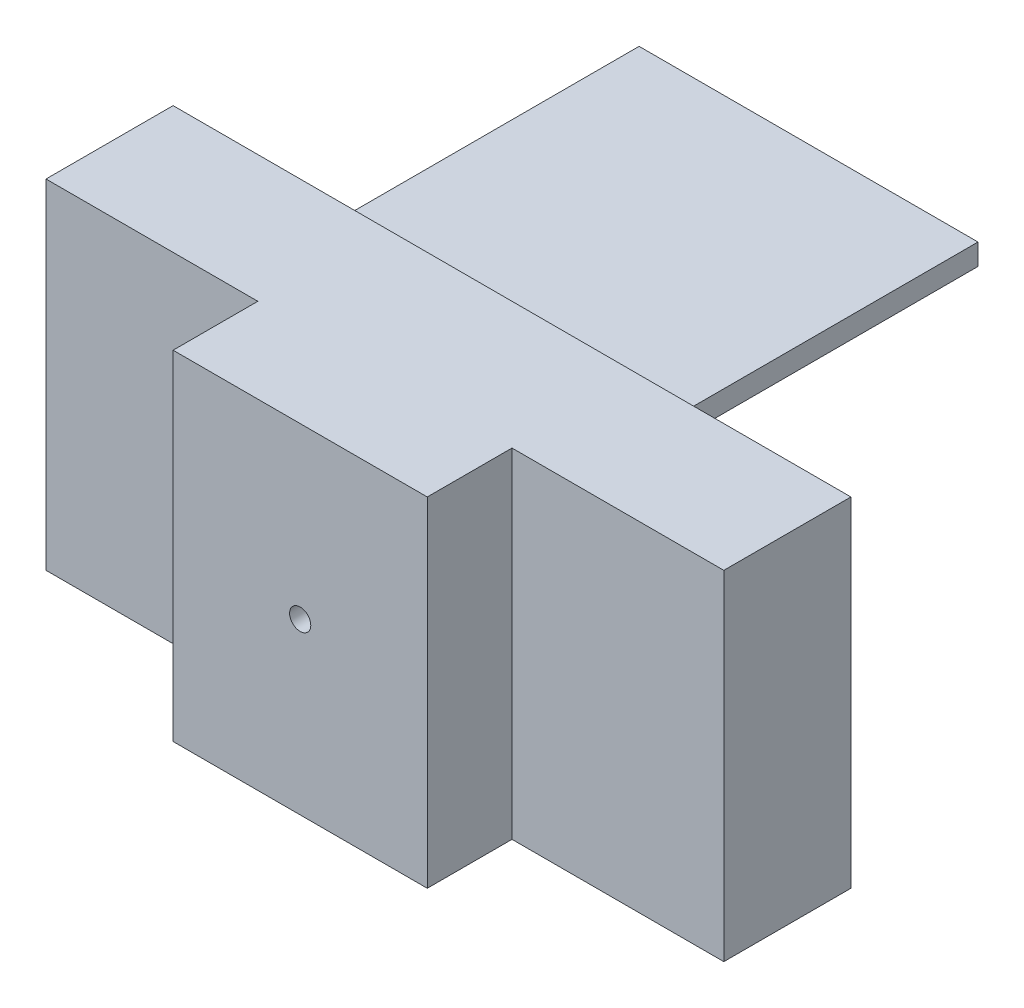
ISO-10303-21;
HEADER;
FILE_DESCRIPTION(('STEP AP214'),'2;1');
FILE_NAME('part.step','',(''),(''),'','','');
FILE_SCHEMA(('AUTOMOTIVE_DESIGN { 1 0 10303 214 1 1 1 1 }'));
ENDSEC;
DATA;
#1=APPLICATION_CONTEXT('core data for automotive mechanical design processes');
#2=APPLICATION_PROTOCOL_DEFINITION('international standard','automotive_design',2000,#1);
#3=PRODUCT_CONTEXT('',#1,'mechanical');
#4=PRODUCT('Part','Part','',(#3));
#5=PRODUCT_RELATED_PRODUCT_CATEGORY('part','',(#4));
#6=PRODUCT_DEFINITION_FORMATION('','',#4);
#7=PRODUCT_DEFINITION_CONTEXT('part definition',#1,'design');
#8=PRODUCT_DEFINITION('design','',#6,#7);
#9=PRODUCT_DEFINITION_SHAPE('','',#8);
#10=(LENGTH_UNIT() NAMED_UNIT(*) SI_UNIT(.MILLI.,.METRE.));
#11=(NAMED_UNIT(*) PLANE_ANGLE_UNIT() SI_UNIT($,.RADIAN.));
#12=(NAMED_UNIT(*) SI_UNIT($,.STERADIAN.) SOLID_ANGLE_UNIT());
#13=UNCERTAINTY_MEASURE_WITH_UNIT(LENGTH_MEASURE(1.E-05),#10,'distance_accuracy_value','');
#14=(GEOMETRIC_REPRESENTATION_CONTEXT(3) GLOBAL_UNCERTAINTY_ASSIGNED_CONTEXT((#13)) GLOBAL_UNIT_ASSIGNED_CONTEXT((#10,
#11,#12)) REPRESENTATION_CONTEXT('',''));
#15=CARTESIAN_POINT('',(0.,0.,0.));
#16=DIRECTION('',(0.,0.,1.));
#17=DIRECTION('',(1.,0.,0.));
#18=AXIS2_PLACEMENT_3D('',#15,#16,#17);
#19=CARTESIAN_POINT('',(-80.,-40.,50.));
#20=DIRECTION('',(0.,1.,0.));
#21=DIRECTION('',(0.,0.,1.));
#22=AXIS2_PLACEMENT_3D('',#19,#20,#21);
#23=PLANE('',#22);
#24=DIRECTION('',(1.,0.,0.));
#25=VECTOR('',#24,1.);
#26=CARTESIAN_POINT('',(0.,-40.,30.));
#27=LINE('',#26,#25);
#28=CARTESIAN_POINT('',(30.,-40.,30.));
#29=VERTEX_POINT('',#28);
#30=CARTESIAN_POINT('',(80.,-40.,30.));
#31=VERTEX_POINT('',#30);
#32=EDGE_CURVE('E237',#29,#31,#27,.T.);
#33=ORIENTED_EDGE('',*,*,#32,.F.);
#34=DIRECTION('',(0.,0.,1.));
#35=VECTOR('',#34,1.);
#36=CARTESIAN_POINT('',(30.,-40.,30.));
#37=LINE('',#36,#35);
#38=CARTESIAN_POINT('',(30.,-40.,50.));
#39=VERTEX_POINT('',#38);
#40=EDGE_CURVE('E244',#29,#39,#37,.T.);
#41=ORIENTED_EDGE('',*,*,#40,.T.);
#42=DIRECTION('',(1.,0.,0.));
#43=VECTOR('',#42,1.);
#44=CARTESIAN_POINT('',(-80.,-40.,50.));
#45=LINE('',#44,#43);
#46=CARTESIAN_POINT('',(-30.,-40.,50.));
#47=VERTEX_POINT('',#46);
#48=EDGE_CURVE('E265',#47,#39,#45,.T.);
#49=ORIENTED_EDGE('',*,*,#48,.F.);
#50=DIRECTION('',(0.,0.,1.));
#51=VECTOR('',#50,1.);
#52=CARTESIAN_POINT('',(-30.,-40.,30.));
#53=LINE('',#52,#51);
#54=CARTESIAN_POINT('',(-30.,-40.,30.));
#55=VERTEX_POINT('',#54);
#56=EDGE_CURVE('E249',#55,#47,#53,.T.);
#57=ORIENTED_EDGE('',*,*,#56,.F.);
#58=DIRECTION('',(1.,0.,0.));
#59=VECTOR('',#58,1.);
#60=CARTESIAN_POINT('',(-80.,-40.,30.));
#61=LINE('',#60,#59);
#62=CARTESIAN_POINT('',(-80.,-40.,30.));
#63=VERTEX_POINT('',#62);
#64=EDGE_CURVE('E256',#63,#55,#61,.T.);
#65=ORIENTED_EDGE('',*,*,#64,.F.);
#66=DIRECTION('',(0.,0.,-1.));
#67=VECTOR('',#66,1.);
#68=CARTESIAN_POINT('',(-80.,-40.,50.));
#69=LINE('',#68,#67);
#70=CARTESIAN_POINT('',(-80.,-40.,0.));
#71=VERTEX_POINT('',#70);
#72=EDGE_CURVE('E272',#63,#71,#69,.T.);
#73=ORIENTED_EDGE('',*,*,#72,.T.);
#74=DIRECTION('',(1.,0.,0.));
#75=VECTOR('',#74,1.);
#76=CARTESIAN_POINT('',(-80.,-40.,0.));
#77=LINE('',#76,#75);
#78=CARTESIAN_POINT('',(80.,-40.,0.));
#79=VERTEX_POINT('',#78);
#80=EDGE_CURVE('E247',#71,#79,#77,.T.);
#81=ORIENTED_EDGE('',*,*,#80,.T.);
#82=DIRECTION('',(0.,0.,-1.));
#83=VECTOR('',#82,1.);
#84=CARTESIAN_POINT('',(80.,-40.,50.));
#85=LINE('',#84,#83);
#86=EDGE_CURVE('E11',#31,#79,#85,.T.);
#87=ORIENTED_EDGE('',*,*,#86,.F.);
#88=EDGE_LOOP('',(#33,#41,#49,#57,#65,#73,#81,#87));
#89=FACE_BOUND('',#88,.T.);
#90=ADVANCED_FACE('F33',(#89),#23,.F.);
#91=CARTESIAN_POINT('',(80.,40.,50.));
#92=DIRECTION('',(1.,0.,0.));
#93=DIRECTION('',(0.,0.,-1.));
#94=AXIS2_PLACEMENT_3D('',#91,#92,#93);
#95=PLANE('',#94);
#96=DIRECTION('',(0.,0.,-1.));
#97=VECTOR('',#96,1.);
#98=CARTESIAN_POINT('',(80.,40.,50.));
#99=LINE('',#98,#97);
#100=CARTESIAN_POINT('',(80.,40.,30.));
#101=VERTEX_POINT('',#100);
#102=CARTESIAN_POINT('',(80.,40.,0.));
#103=VERTEX_POINT('',#102);
#104=EDGE_CURVE('E40',#101,#103,#99,.T.);
#105=ORIENTED_EDGE('',*,*,#104,.F.);
#106=DIRECTION('',(0.,1.,0.));
#107=VECTOR('',#106,1.);
#108=CARTESIAN_POINT('',(80.,0.,30.));
#109=LINE('',#108,#107);
#110=EDGE_CURVE('E239',#31,#101,#109,.T.);
#111=ORIENTED_EDGE('',*,*,#110,.F.);
#112=ORIENTED_EDGE('',*,*,#86,.T.);
#113=DIRECTION('',(0.,-1.,0.));
#114=VECTOR('',#113,1.);
#115=CARTESIAN_POINT('',(80.,40.,0.));
#116=LINE('',#115,#114);
#117=EDGE_CURVE('E275',#103,#79,#116,.T.);
#118=ORIENTED_EDGE('',*,*,#117,.F.);
#119=EDGE_LOOP('',(#105,#111,#112,#118));
#120=FACE_BOUND('',#119,.T.);
#121=ADVANCED_FACE('F295',(#120),#95,.T.);
#122=CARTESIAN_POINT('',(-80.,40.,50.));
#123=DIRECTION('',(0.,1.,0.));
#124=DIRECTION('',(0.,0.,1.));
#125=AXIS2_PLACEMENT_3D('',#122,#123,#124);
#126=PLANE('',#125);
#127=DIRECTION('',(0.,0.,1.));
#128=VECTOR('',#127,1.);
#129=CARTESIAN_POINT('',(30.,40.,30.));
#130=LINE('',#129,#128);
#131=CARTESIAN_POINT('',(30.,40.,30.));
#132=VERTEX_POINT('',#131);
#133=CARTESIAN_POINT('',(30.,40.,50.));
#134=VERTEX_POINT('',#133);
#135=EDGE_CURVE('E241',#132,#134,#130,.T.);
#136=ORIENTED_EDGE('',*,*,#135,.F.);
#137=DIRECTION('',(-1.,0.,0.));
#138=VECTOR('',#137,1.);
#139=CARTESIAN_POINT('',(0.,40.,30.));
#140=LINE('',#139,#138);
#141=EDGE_CURVE('E230',#101,#132,#140,.T.);
#142=ORIENTED_EDGE('',*,*,#141,.F.);
#143=ORIENTED_EDGE('',*,*,#104,.T.);
#144=DIRECTION('',(1.,0.,0.));
#145=VECTOR('',#144,1.);
#146=CARTESIAN_POINT('',(-80.,40.,0.));
#147=LINE('',#146,#145);
#148=CARTESIAN_POINT('',(-80.,40.,0.));
#149=VERTEX_POINT('',#148);
#150=EDGE_CURVE('E278',#149,#103,#147,.T.);
#151=ORIENTED_EDGE('',*,*,#150,.F.);
#152=DIRECTION('',(0.,0.,-1.));
#153=VECTOR('',#152,1.);
#154=CARTESIAN_POINT('',(-80.,40.,50.));
#155=LINE('',#154,#153);
#156=CARTESIAN_POINT('',(-80.,40.,30.));
#157=VERTEX_POINT('',#156);
#158=EDGE_CURVE('E284',#157,#149,#155,.T.);
#159=ORIENTED_EDGE('',*,*,#158,.F.);
#160=DIRECTION('',(1.,0.,0.));
#161=VECTOR('',#160,1.);
#162=CARTESIAN_POINT('',(-80.,40.,30.));
#163=LINE('',#162,#161);
#164=CARTESIAN_POINT('',(-30.,40.,30.));
#165=VERTEX_POINT('',#164);
#166=EDGE_CURVE('E258',#157,#165,#163,.T.);
#167=ORIENTED_EDGE('',*,*,#166,.T.);
#168=DIRECTION('',(0.,0.,1.));
#169=VECTOR('',#168,1.);
#170=CARTESIAN_POINT('',(-30.,40.,30.));
#171=LINE('',#170,#169);
#172=CARTESIAN_POINT('',(-30.,40.,50.));
#173=VERTEX_POINT('',#172);
#174=EDGE_CURVE('E227',#165,#173,#171,.T.);
#175=ORIENTED_EDGE('',*,*,#174,.T.);
#176=DIRECTION('',(1.,0.,0.));
#177=VECTOR('',#176,1.);
#178=CARTESIAN_POINT('',(-80.,40.,50.));
#179=LINE('',#178,#177);
#180=EDGE_CURVE('E268',#173,#134,#179,.T.);
#181=ORIENTED_EDGE('',*,*,#180,.T.);
#182=EDGE_LOOP('',(#136,#142,#143,#151,#159,#167,#175,#181));
#183=FACE_BOUND('',#182,.T.);
#184=ADVANCED_FACE('F291',(#183),#126,.T.);
#185=CARTESIAN_POINT('',(0.,0.,50.));
#186=DIRECTION('',(0.,0.,-1.));
#187=DIRECTION('',(-1.,0.,0.));
#188=AXIS2_PLACEMENT_3D('',#185,#186,#187);
#189=PLANE('',#188);
#190=CARTESIAN_POINT('',(0.,0.,50.));
#191=DIRECTION('',(0.,0.,1.));
#192=DIRECTION('',(1.,0.,0.));
#193=AXIS2_PLACEMENT_3D('',#190,#191,#192);
#194=CIRCLE('',#193,2.5);
#195=CARTESIAN_POINT('',(-0.256559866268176,2.48680056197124,50.));
#196=VERTEX_POINT('',#195);
#197=CARTESIAN_POINT('',(0.232741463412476,2.48914270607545,50.));
#198=VERTEX_POINT('',#197);
#199=EDGE_CURVE('E218',#196,#198,#194,.T.);
#200=ORIENTED_EDGE('',*,*,#199,.F.);
#201=DIRECTION('',(-0.999988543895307,-0.00478665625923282,0.));
#202=VECTOR('',#201,1.);
#203=CARTESIAN_POINT('',(-0.0119092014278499,2.48797163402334,50.));
#204=LINE('',#203,#202);
#205=EDGE_CURVE('E206',#198,#196,#204,.T.);
#206=ORIENTED_EDGE('',*,*,#205,.F.);
#207=EDGE_LOOP('',(#200,#206));
#208=FACE_BOUND('',#207,.T.);
#209=ORIENTED_EDGE('',*,*,#48,.T.);
#210=DIRECTION('',(0.,-1.,0.));
#211=VECTOR('',#210,1.);
#212=CARTESIAN_POINT('',(30.,0.,50.));
#213=LINE('',#212,#211);
#214=EDGE_CURVE('E234',#134,#39,#213,.T.);
#215=ORIENTED_EDGE('',*,*,#214,.F.);
#216=ORIENTED_EDGE('',*,*,#180,.F.);
#217=DIRECTION('',(0.,-1.,0.));
#218=VECTOR('',#217,1.);
#219=CARTESIAN_POINT('',(-30.,40.,50.));
#220=LINE('',#219,#218);
#221=EDGE_CURVE('E243',#173,#47,#220,.T.);
#222=ORIENTED_EDGE('',*,*,#221,.T.);
#223=EDGE_LOOP('',(#209,#215,#216,#222));
#224=FACE_BOUND('',#223,.T.);
#225=ADVANCED_FACE('F315',(#208,#224),#189,.F.);
#226=CARTESIAN_POINT('',(-80.,40.,50.));
#227=DIRECTION('',(1.,0.,0.));
#228=DIRECTION('',(0.,1.,0.));
#229=AXIS2_PLACEMENT_3D('',#226,#227,#228);
#230=PLANE('',#229);
#231=ORIENTED_EDGE('',*,*,#72,.F.);
#232=DIRECTION('',(0.,-1.,0.));
#233=VECTOR('',#232,1.);
#234=CARTESIAN_POINT('',(-80.,40.,30.));
#235=LINE('',#234,#233);
#236=EDGE_CURVE('E251',#157,#63,#235,.T.);
#237=ORIENTED_EDGE('',*,*,#236,.F.);
#238=ORIENTED_EDGE('',*,*,#158,.T.);
#239=DIRECTION('',(0.,-1.,0.));
#240=VECTOR('',#239,1.);
#241=CARTESIAN_POINT('',(-80.,40.,0.));
#242=LINE('',#241,#240);
#243=EDGE_CURVE('E269',#149,#71,#242,.T.);
#244=ORIENTED_EDGE('',*,*,#243,.T.);
#245=EDGE_LOOP('',(#231,#237,#238,#244));
#246=FACE_BOUND('',#245,.T.);
#247=ADVANCED_FACE('F303',(#246),#230,.F.);
#248=CARTESIAN_POINT('',(0.,0.,0.));
#249=DIRECTION('',(0.,0.,-1.));
#250=DIRECTION('',(-1.,0.,0.));
#251=AXIS2_PLACEMENT_3D('',#248,#249,#250);
#252=PLANE('',#251);
#253=DIRECTION('',(0.,1.,0.));
#254=VECTOR('',#253,1.);
#255=CARTESIAN_POINT('',(-40.,32.1184310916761,0.));
#256=LINE('',#255,#254);
#257=CARTESIAN_POINT('',(-40.,32.1184310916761,0.));
#258=VERTEX_POINT('',#257);
#259=CARTESIAN_POINT('',(-40.,37.1184310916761,0.));
#260=VERTEX_POINT('',#259);
#261=EDGE_CURVE('E167',#258,#260,#256,.T.);
#262=ORIENTED_EDGE('',*,*,#261,.F.);
#263=DIRECTION('',(0.,-1.,0.));
#264=VECTOR('',#263,1.);
#265=CARTESIAN_POINT('',(-40.,32.1184310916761,0.));
#266=LINE('',#265,#264);
#267=CARTESIAN_POINT('',(-40.,22.1184310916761,0.));
#268=VERTEX_POINT('',#267);
#269=EDGE_CURVE('E199',#258,#268,#266,.T.);
#270=ORIENTED_EDGE('',*,*,#269,.T.);
#271=DIRECTION('',(-1.,0.,0.));
#272=VECTOR('',#271,1.);
#273=CARTESIAN_POINT('',(40.,22.1184310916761,0.));
#274=LINE('',#273,#272);
#275=CARTESIAN_POINT('',(40.,22.1184310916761,0.));
#276=VERTEX_POINT('',#275);
#277=EDGE_CURVE('E55',#276,#268,#274,.T.);
#278=ORIENTED_EDGE('',*,*,#277,.F.);
#279=DIRECTION('',(0.,-1.,0.));
#280=VECTOR('',#279,1.);
#281=CARTESIAN_POINT('',(40.,32.1184310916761,0.));
#282=LINE('',#281,#280);
#283=CARTESIAN_POINT('',(40.,32.1184310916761,0.));
#284=VERTEX_POINT('',#283);
#285=EDGE_CURVE('E190',#284,#276,#282,.T.);
#286=ORIENTED_EDGE('',*,*,#285,.F.);
#287=DIRECTION('',(0.,1.,0.));
#288=VECTOR('',#287,1.);
#289=CARTESIAN_POINT('',(40.,32.1184310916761,0.));
#290=LINE('',#289,#288);
#291=CARTESIAN_POINT('',(40.,37.1184310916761,0.));
#292=VERTEX_POINT('',#291);
#293=EDGE_CURVE('E173',#284,#292,#290,.T.);
#294=ORIENTED_EDGE('',*,*,#293,.T.);
#295=DIRECTION('',(-1.,0.,0.));
#296=VECTOR('',#295,1.);
#297=CARTESIAN_POINT('',(40.,37.1184310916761,0.));
#298=LINE('',#297,#296);
#299=EDGE_CURVE('E47',#292,#260,#298,.T.);
#300=ORIENTED_EDGE('',*,*,#299,.T.);
#301=EDGE_LOOP('',(#262,#270,#278,#286,#294,#300));
#302=FACE_BOUND('',#301,.T.);
#303=ORIENTED_EDGE('',*,*,#80,.F.);
#304=ORIENTED_EDGE('',*,*,#243,.F.);
#305=ORIENTED_EDGE('',*,*,#150,.T.);
#306=ORIENTED_EDGE('',*,*,#117,.T.);
#307=EDGE_LOOP('',(#303,#304,#305,#306));
#308=FACE_BOUND('',#307,.T.);
#309=ADVANCED_FACE('F300',(#302,#308),#252,.T.);
#310=CARTESIAN_POINT('',(-30.,40.,30.));
#311=DIRECTION('',(-1.,0.,0.));
#312=DIRECTION('',(0.,0.,1.));
#313=AXIS2_PLACEMENT_3D('',#310,#311,#312);
#314=PLANE('',#313);
#315=ORIENTED_EDGE('',*,*,#221,.F.);
#316=ORIENTED_EDGE('',*,*,#174,.F.);
#317=DIRECTION('',(0.,-1.,0.));
#318=VECTOR('',#317,1.);
#319=CARTESIAN_POINT('',(-30.,40.,30.));
#320=LINE('',#319,#318);
#321=EDGE_CURVE('E261',#165,#55,#320,.T.);
#322=ORIENTED_EDGE('',*,*,#321,.T.);
#323=ORIENTED_EDGE('',*,*,#56,.T.);
#324=EDGE_LOOP('',(#315,#316,#322,#323));
#325=FACE_BOUND('',#324,.T.);
#326=ADVANCED_FACE('F312',(#325),#314,.T.);
#327=CARTESIAN_POINT('',(0.,0.,30.));
#328=DIRECTION('',(0.,0.,-1.));
#329=DIRECTION('',(-1.,0.,0.));
#330=AXIS2_PLACEMENT_3D('',#327,#328,#329);
#331=PLANE('',#330);
#332=ORIENTED_EDGE('',*,*,#64,.T.);
#333=ORIENTED_EDGE('',*,*,#321,.F.);
#334=ORIENTED_EDGE('',*,*,#166,.F.);
#335=ORIENTED_EDGE('',*,*,#236,.T.);
#336=EDGE_LOOP('',(#332,#333,#334,#335));
#337=FACE_BOUND('',#336,.T.);
#338=ADVANCED_FACE('F308',(#337),#331,.F.);
#339=CARTESIAN_POINT('',(30.,0.,30.));
#340=DIRECTION('',(-1.,0.,0.));
#341=DIRECTION('',(0.,-1.,0.));
#342=AXIS2_PLACEMENT_3D('',#339,#340,#341);
#343=PLANE('',#342);
#344=ORIENTED_EDGE('',*,*,#214,.T.);
#345=ORIENTED_EDGE('',*,*,#40,.F.);
#346=DIRECTION('',(0.,-1.,0.));
#347=VECTOR('',#346,1.);
#348=CARTESIAN_POINT('',(30.,0.,30.));
#349=LINE('',#348,#347);
#350=EDGE_CURVE('E233',#132,#29,#349,.T.);
#351=ORIENTED_EDGE('',*,*,#350,.F.);
#352=ORIENTED_EDGE('',*,*,#135,.T.);
#353=EDGE_LOOP('',(#344,#345,#351,#352));
#354=FACE_BOUND('',#353,.T.);
#355=ADVANCED_FACE('F320',(#354),#343,.F.);
#356=CARTESIAN_POINT('',(0.,0.,30.));
#357=DIRECTION('',(0.,0.,1.));
#358=DIRECTION('',(1.,0.,0.));
#359=AXIS2_PLACEMENT_3D('',#356,#357,#358);
#360=PLANE('',#359);
#361=ORIENTED_EDGE('',*,*,#141,.T.);
#362=ORIENTED_EDGE('',*,*,#350,.T.);
#363=ORIENTED_EDGE('',*,*,#32,.T.);
#364=ORIENTED_EDGE('',*,*,#110,.T.);
#365=EDGE_LOOP('',(#361,#362,#363,#364));
#366=FACE_BOUND('',#365,.T.);
#367=ADVANCED_FACE('F322',(#366),#360,.T.);
#368=CARTESIAN_POINT('',(-0.0119092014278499,2.48797163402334,28.));
#369=DIRECTION('',(-0.00478665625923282,0.999988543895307,0.));
#370=DIRECTION('',(-0.999988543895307,-0.00478665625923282,0.));
#371=AXIS2_PLACEMENT_3D('',#368,#369,#370);
#372=PLANE('',#371);
#373=ORIENTED_EDGE('',*,*,#205,.T.);
#374=DIRECTION('',(0.,0.,1.));
#375=VECTOR('',#374,1.);
#376=CARTESIAN_POINT('',(-0.256559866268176,2.48680056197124,28.));
#377=LINE('',#376,#375);
#378=CARTESIAN_POINT('',(-0.256559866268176,2.48680056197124,28.));
#379=VERTEX_POINT('',#378);
#380=EDGE_CURVE('E221',#379,#196,#377,.T.);
#381=ORIENTED_EDGE('',*,*,#380,.F.);
#382=DIRECTION('',(-0.999988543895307,-0.00478665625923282,0.));
#383=VECTOR('',#382,1.);
#384=CARTESIAN_POINT('',(-0.0119092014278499,2.48797163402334,28.));
#385=LINE('',#384,#383);
#386=CARTESIAN_POINT('',(0.232741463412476,2.48914270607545,28.));
#387=VERTEX_POINT('',#386);
#388=EDGE_CURVE('E214',#387,#379,#385,.T.);
#389=ORIENTED_EDGE('',*,*,#388,.F.);
#390=DIRECTION('',(0.,0.,1.));
#391=VECTOR('',#390,1.);
#392=CARTESIAN_POINT('',(0.232741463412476,2.48914270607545,28.));
#393=LINE('',#392,#391);
#394=EDGE_CURVE('E225',#387,#198,#393,.T.);
#395=ORIENTED_EDGE('',*,*,#394,.T.);
#396=EDGE_LOOP('',(#373,#381,#389,#395));
#397=FACE_BOUND('',#396,.T.);
#398=ADVANCED_FACE('F324',(#397),#372,.F.);
#399=CARTESIAN_POINT('',(0.,0.,28.));
#400=DIRECTION('',(0.,0.,1.));
#401=DIRECTION('',(1.,0.,0.));
#402=AXIS2_PLACEMENT_3D('',#399,#400,#401);
#403=CYLINDRICAL_SURFACE('',#402,2.5);
#404=ORIENTED_EDGE('',*,*,#199,.T.);
#405=ORIENTED_EDGE('',*,*,#394,.F.);
#406=CARTESIAN_POINT('',(0.,0.,28.));
#407=DIRECTION('',(0.,0.,1.));
#408=DIRECTION('',(1.,0.,0.));
#409=AXIS2_PLACEMENT_3D('',#406,#407,#408);
#410=CIRCLE('',#409,2.5);
#411=EDGE_CURVE('E217',#379,#387,#410,.T.);
#412=ORIENTED_EDGE('',*,*,#411,.F.);
#413=ORIENTED_EDGE('',*,*,#380,.T.);
#414=EDGE_LOOP('',(#404,#405,#412,#413));
#415=FACE_BOUND('',#414,.T.);
#416=ADVANCED_FACE('F330',(#415),#403,.F.);
#417=CARTESIAN_POINT('',(0.,0.,28.));
#418=DIRECTION('',(0.,0.,1.));
#419=DIRECTION('',(1.,0.,0.));
#420=AXIS2_PLACEMENT_3D('',#417,#418,#419);
#421=PLANE('',#420);
#422=ORIENTED_EDGE('',*,*,#388,.T.);
#423=ORIENTED_EDGE('',*,*,#411,.T.);
#424=EDGE_LOOP('',(#422,#423));
#425=FACE_BOUND('',#424,.T.);
#426=ADVANCED_FACE('F394',(#425),#421,.T.);
#427=CARTESIAN_POINT('',(40.,22.1184310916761,5.));
#428=DIRECTION('',(0.,-1.,0.));
#429=DIRECTION('',(0.,0.,-1.));
#430=AXIS2_PLACEMENT_3D('',#427,#428,#429);
#431=PLANE('',#430);
#432=ORIENTED_EDGE('',*,*,#277,.T.);
#433=DIRECTION('',(0.,0.,-1.));
#434=VECTOR('',#433,1.);
#435=CARTESIAN_POINT('',(-40.,22.1184310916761,5.));
#436=LINE('',#435,#434);
#437=CARTESIAN_POINT('',(-40.,22.1184310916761,5.));
#438=VERTEX_POINT('',#437);
#439=EDGE_CURVE('E197',#438,#268,#436,.T.);
#440=ORIENTED_EDGE('',*,*,#439,.F.);
#441=DIRECTION('',(-1.,0.,0.));
#442=VECTOR('',#441,1.);
#443=CARTESIAN_POINT('',(40.,22.1184310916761,5.));
#444=LINE('',#443,#442);
#445=CARTESIAN_POINT('',(40.,22.1184310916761,5.));
#446=VERTEX_POINT('',#445);
#447=EDGE_CURVE('E186',#446,#438,#444,.T.);
#448=ORIENTED_EDGE('',*,*,#447,.F.);
#449=DIRECTION('',(0.,0.,-1.));
#450=VECTOR('',#449,1.);
#451=CARTESIAN_POINT('',(40.,22.1184310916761,5.));
#452=LINE('',#451,#450);
#453=EDGE_CURVE('E204',#446,#276,#452,.T.);
#454=ORIENTED_EDGE('',*,*,#453,.T.);
#455=EDGE_LOOP('',(#432,#440,#448,#454));
#456=FACE_BOUND('',#455,.T.);
#457=ADVANCED_FACE('F404',(#456),#431,.F.);
#458=CARTESIAN_POINT('',(40.,32.1184310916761,5.));
#459=DIRECTION('',(1.,0.,0.));
#460=DIRECTION('',(0.,0.,-1.));
#461=AXIS2_PLACEMENT_3D('',#458,#459,#460);
#462=PLANE('',#461);
#463=ORIENTED_EDGE('',*,*,#285,.T.);
#464=ORIENTED_EDGE('',*,*,#453,.F.);
#465=DIRECTION('',(0.,-1.,0.));
#466=VECTOR('',#465,1.);
#467=CARTESIAN_POINT('',(40.,32.1184310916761,5.));
#468=LINE('',#467,#466);
#469=CARTESIAN_POINT('',(40.,32.1184310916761,5.));
#470=VERTEX_POINT('',#469);
#471=EDGE_CURVE('E194',#470,#446,#468,.T.);
#472=ORIENTED_EDGE('',*,*,#471,.F.);
#473=DIRECTION('',(0.,0.,-1.));
#474=VECTOR('',#473,1.);
#475=CARTESIAN_POINT('',(40.,32.1184310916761,5.));
#476=LINE('',#475,#474);
#477=EDGE_CURVE('E207',#470,#284,#476,.T.);
#478=ORIENTED_EDGE('',*,*,#477,.T.);
#479=EDGE_LOOP('',(#463,#464,#472,#478));
#480=FACE_BOUND('',#479,.T.);
#481=ADVANCED_FACE('F414',(#480),#462,.F.);
#482=CARTESIAN_POINT('',(40.,32.1184310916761,5.));
#483=DIRECTION('',(0.,-1.,0.));
#484=DIRECTION('',(0.,0.,-1.));
#485=AXIS2_PLACEMENT_3D('',#482,#483,#484);
#486=PLANE('',#485);
#487=DIRECTION('',(0.,0.,-1.));
#488=VECTOR('',#487,1.);
#489=CARTESIAN_POINT('',(-40.,32.1184310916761,5.));
#490=LINE('',#489,#488);
#491=CARTESIAN_POINT('',(-40.,32.1184310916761,5.));
#492=VERTEX_POINT('',#491);
#493=EDGE_CURVE('E210',#492,#258,#490,.T.);
#494=ORIENTED_EDGE('',*,*,#493,.T.);
#495=DIRECTION('',(0.,0.,1.));
#496=VECTOR('',#495,1.);
#497=CARTESIAN_POINT('',(-40.,32.1184310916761,-70.));
#498=LINE('',#497,#496);
#499=CARTESIAN_POINT('',(-40.,32.1184310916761,-70.));
#500=VERTEX_POINT('',#499);
#501=EDGE_CURVE('E168',#500,#258,#498,.T.);
#502=ORIENTED_EDGE('',*,*,#501,.F.);
#503=DIRECTION('',(-1.,0.,0.));
#504=VECTOR('',#503,1.);
#505=CARTESIAN_POINT('',(40.,32.1184310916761,-70.));
#506=LINE('',#505,#504);
#507=CARTESIAN_POINT('',(40.,32.1184310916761,-70.));
#508=VERTEX_POINT('',#507);
#509=EDGE_CURVE('E159',#508,#500,#506,.T.);
#510=ORIENTED_EDGE('',*,*,#509,.F.);
#511=DIRECTION('',(0.,0.,1.));
#512=VECTOR('',#511,1.);
#513=CARTESIAN_POINT('',(40.,32.1184310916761,-70.));
#514=LINE('',#513,#512);
#515=EDGE_CURVE('E183',#508,#284,#514,.T.);
#516=ORIENTED_EDGE('',*,*,#515,.T.);
#517=ORIENTED_EDGE('',*,*,#477,.F.);
#518=DIRECTION('',(-1.,0.,0.));
#519=VECTOR('',#518,1.);
#520=CARTESIAN_POINT('',(40.,32.1184310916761,5.));
#521=LINE('',#520,#519);
#522=EDGE_CURVE('E192',#470,#492,#521,.T.);
#523=ORIENTED_EDGE('',*,*,#522,.T.);
#524=EDGE_LOOP('',(#494,#502,#510,#516,#517,#523));
#525=FACE_BOUND('',#524,.T.);
#526=ADVANCED_FACE('F442',(#525),#486,.T.);
#527=CARTESIAN_POINT('',(-40.,32.1184310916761,5.));
#528=DIRECTION('',(1.,0.,0.));
#529=DIRECTION('',(0.,0.,-1.));
#530=AXIS2_PLACEMENT_3D('',#527,#528,#529);
#531=PLANE('',#530);
#532=ORIENTED_EDGE('',*,*,#269,.F.);
#533=ORIENTED_EDGE('',*,*,#493,.F.);
#534=DIRECTION('',(0.,-1.,0.));
#535=VECTOR('',#534,1.);
#536=CARTESIAN_POINT('',(-40.,32.1184310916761,5.));
#537=LINE('',#536,#535);
#538=EDGE_CURVE('E189',#492,#438,#537,.T.);
#539=ORIENTED_EDGE('',*,*,#538,.T.);
#540=ORIENTED_EDGE('',*,*,#439,.T.);
#541=EDGE_LOOP('',(#532,#533,#539,#540));
#542=FACE_BOUND('',#541,.T.);
#543=ADVANCED_FACE('F425',(#542),#531,.T.);
#544=CARTESIAN_POINT('',(0.,0.,5.));
#545=DIRECTION('',(0.,0.,1.));
#546=DIRECTION('',(1.,0.,0.));
#547=AXIS2_PLACEMENT_3D('',#544,#545,#546);
#548=PLANE('',#547);
#549=ORIENTED_EDGE('',*,*,#447,.T.);
#550=ORIENTED_EDGE('',*,*,#538,.F.);
#551=ORIENTED_EDGE('',*,*,#522,.F.);
#552=ORIENTED_EDGE('',*,*,#471,.T.);
#553=EDGE_LOOP('',(#549,#550,#551,#552));
#554=FACE_BOUND('',#553,.T.);
#555=ADVANCED_FACE('F421',(#554),#548,.F.);
#556=CARTESIAN_POINT('',(40.,37.1184310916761,-70.));
#557=DIRECTION('',(0.,1.,0.));
#558=DIRECTION('',(0.,0.,1.));
#559=AXIS2_PLACEMENT_3D('',#556,#557,#558);
#560=PLANE('',#559);
#561=ORIENTED_EDGE('',*,*,#299,.F.);
#562=DIRECTION('',(0.,0.,1.));
#563=VECTOR('',#562,1.);
#564=CARTESIAN_POINT('',(40.,37.1184310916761,-70.));
#565=LINE('',#564,#563);
#566=CARTESIAN_POINT('',(40.,37.1184310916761,-70.));
#567=VERTEX_POINT('',#566);
#568=EDGE_CURVE('E172',#567,#292,#565,.T.);
#569=ORIENTED_EDGE('',*,*,#568,.F.);
#570=DIRECTION('',(-1.,0.,0.));
#571=VECTOR('',#570,1.);
#572=CARTESIAN_POINT('',(40.,37.1184310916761,-70.));
#573=LINE('',#572,#571);
#574=CARTESIAN_POINT('',(-40.,37.1184310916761,-70.));
#575=VERTEX_POINT('',#574);
#576=EDGE_CURVE('E156',#567,#575,#573,.T.);
#577=ORIENTED_EDGE('',*,*,#576,.T.);
#578=DIRECTION('',(0.,0.,1.));
#579=VECTOR('',#578,1.);
#580=CARTESIAN_POINT('',(-40.,37.1184310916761,-70.));
#581=LINE('',#580,#579);
#582=EDGE_CURVE('E164',#575,#260,#581,.T.);
#583=ORIENTED_EDGE('',*,*,#582,.T.);
#584=EDGE_LOOP('',(#561,#569,#577,#583));
#585=FACE_BOUND('',#584,.T.);
#586=ADVANCED_FACE('F171',(#585),#560,.T.);
#587=CARTESIAN_POINT('',(40.,32.1184310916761,-70.));
#588=DIRECTION('',(1.,0.,0.));
#589=DIRECTION('',(0.,0.,-1.));
#590=AXIS2_PLACEMENT_3D('',#587,#588,#589);
#591=PLANE('',#590);
#592=ORIENTED_EDGE('',*,*,#293,.F.);
#593=ORIENTED_EDGE('',*,*,#515,.F.);
#594=DIRECTION('',(0.,1.,0.));
#595=VECTOR('',#594,1.);
#596=CARTESIAN_POINT('',(40.,32.1184310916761,-70.));
#597=LINE('',#596,#595);
#598=EDGE_CURVE('E169',#508,#567,#597,.T.);
#599=ORIENTED_EDGE('',*,*,#598,.T.);
#600=ORIENTED_EDGE('',*,*,#568,.T.);
#601=EDGE_LOOP('',(#592,#593,#599,#600));
#602=FACE_BOUND('',#601,.T.);
#603=ADVANCED_FACE('F467',(#602),#591,.T.);
#604=CARTESIAN_POINT('',(-40.,32.1184310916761,-70.));
#605=DIRECTION('',(1.,0.,0.));
#606=DIRECTION('',(0.,0.,-1.));
#607=AXIS2_PLACEMENT_3D('',#604,#605,#606);
#608=PLANE('',#607);
#609=ORIENTED_EDGE('',*,*,#261,.T.);
#610=ORIENTED_EDGE('',*,*,#582,.F.);
#611=DIRECTION('',(0.,1.,0.));
#612=VECTOR('',#611,1.);
#613=CARTESIAN_POINT('',(-40.,32.1184310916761,-70.));
#614=LINE('',#613,#612);
#615=EDGE_CURVE('E151',#500,#575,#614,.T.);
#616=ORIENTED_EDGE('',*,*,#615,.F.);
#617=ORIENTED_EDGE('',*,*,#501,.T.);
#618=EDGE_LOOP('',(#609,#610,#616,#617));
#619=FACE_BOUND('',#618,.T.);
#620=ADVANCED_FACE('F165',(#619),#608,.F.);
#621=CARTESIAN_POINT('',(0.,0.,-70.));
#622=DIRECTION('',(0.,0.,-1.));
#623=DIRECTION('',(-1.,0.,0.));
#624=AXIS2_PLACEMENT_3D('',#621,#622,#623);
#625=PLANE('',#624);
#626=ORIENTED_EDGE('',*,*,#576,.F.);
#627=ORIENTED_EDGE('',*,*,#598,.F.);
#628=ORIENTED_EDGE('',*,*,#509,.T.);
#629=ORIENTED_EDGE('',*,*,#615,.T.);
#630=EDGE_LOOP('',(#626,#627,#628,#629));
#631=FACE_BOUND('',#630,.T.);
#632=ADVANCED_FACE('F153',(#631),#625,.T.);
#633=CLOSED_SHELL('',(#90,#121,#184,#225,#247,#309,#326,#338,#355,#367,#398,#416,#426,#457,#481,
#526,#543,#555,#586,#603,#620,#632));
#634=MANIFOLD_SOLID_BREP('B2',#633);
#635=ADVANCED_BREP_SHAPE_REPRESENTATION('',(#18,#634),#14);
#636=SHAPE_DEFINITION_REPRESENTATION(#9,#635);
ENDSEC;
END-ISO-10303-21;
